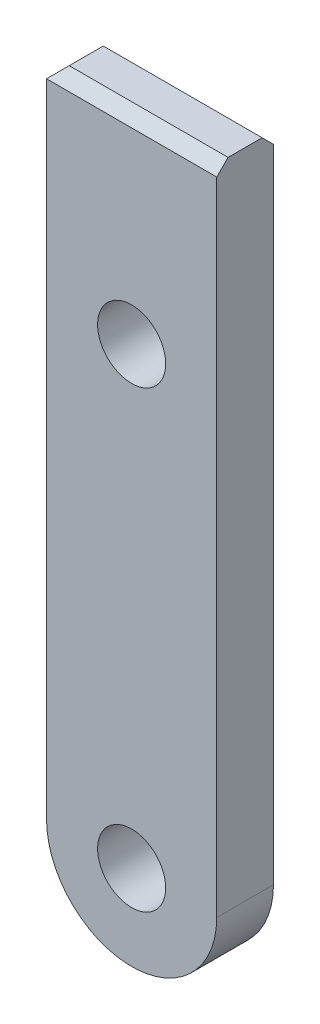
from build123d import *

# Parameters (mm, degrees)
EXTRUSION1_DEPTH        = 10
ESQUISSE2_R             = 6
ENL_V_MAT_EXTRU_1_DEPTH = 10
CHANFREIN1_SIZE         = 2
CHANFREIN2_SIZE         = 2


with BuildPart() as part:
    # Esquisse1 → Extrusion1 (new body)
    with BuildSketch(Plane.XY):
        with BuildLine():
            Line((0, 0), (30, 0))
            Line((30, 0), (30, -115))
            ThreePointArc((30, -115), (15, -130), (0, -115))
            Line((0, -115), (0, 0))
        make_face()
    extrude(amount=EXTRUSION1_DEPTH)

    # Esquisse2 → Enl_v. mat.-Extru.1 (cut)
    with BuildSketch(Plane.XY.offset(10)):
        with Locations((15, -115)):
            Circle(ESQUISSE2_R)
        with Locations((15, -35)):
            Circle(ESQUISSE2_R)
    extrude(amount=-ENL_V_MAT_EXTRU_1_DEPTH, mode=Mode.SUBTRACT)

    # Chanfrein1
    chanfrein1_edges = [part.edges().sort_by_distance(p)[0] for p in [
        (15, 0, 10),
        (15, 0, 0),
    ]]
    chamfer(chanfrein1_edges, length=CHANFREIN1_SIZE)

    # Chanfrein2
    chanfrein2_edges = [part.edges().sort_by_distance(p)[0] for p in [
        (0, 0, 5),
    ]]
    chamfer(chanfrein2_edges, length=CHANFREIN2_SIZE)


solid = part.part
